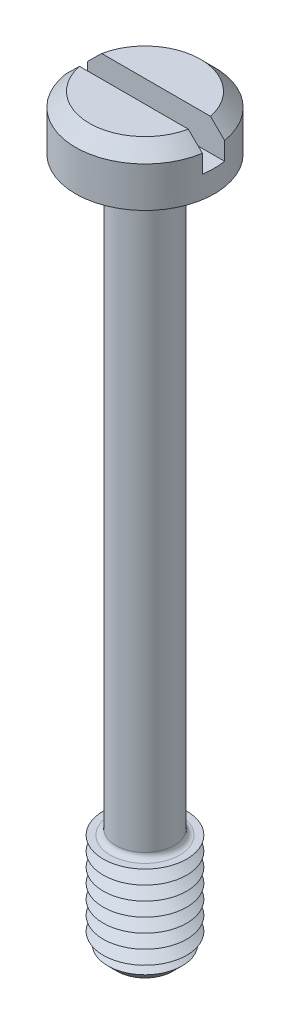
from build123d import *

# Parameters (mm, degrees)
SKETCH1_R           = 5
BOSS_EXTRUDE1_DEPTH = 3.9
SKETCH2_R           = 2.1
BOSS_EXTRUDE2_DEPTH = 50
SKETCH3_R           = 3
BOSS_EXTRUDE3_DEPTH = 7.5
CHAMFER1_SIZE       = 1
LPATTERN1_COUNT     = 7
LPATTERN1_PITCH     = 1
FILLET1_R           = 0.4
CHAMFER2_SIZE       = 1
SKETCH6_W           = 10
SKETCH6_H           = 1.6
CUT_EXTRUDE1_DEPTH  = 2.3


with BuildPart() as part:
    # Sketch1 → Boss-Extrude1 (new body)
    with BuildSketch(Plane(origin=(0, 0, 0), x_dir=(1, 0, 0), z_dir=(0, 1, 0))):
        with Locations(Location((0, 0, 0), (0, 0, 270))):
            Circle(SKETCH1_R)
    extrude(amount=BOSS_EXTRUDE1_DEPTH)

    # Sketch2 → Boss-Extrude2 (add)
    with BuildSketch(Plane.XZ):
        with Locations(Location((0, 0, 0), (0, 0, 270))):
            Circle(SKETCH2_R)
    extrude(amount=BOSS_EXTRUDE2_DEPTH)

    # Sketch3 → Boss-Extrude3 (add)
    with BuildSketch(Plane.XZ.offset(50)):
        with Locations(Location((0, 0, 0), (0, 0, 270))):
            Circle(SKETCH3_R)
    extrude(amount=-BOSS_EXTRUDE3_DEPTH)

    # Chamfer1
    chamfer1_edges = [part.edges().sort_by_distance(p)[0] for p in [
        (0, -50, 3),
    ]]
    chamfer(chamfer1_edges, length=CHAMFER1_SIZE)

    # Sketch5 → Cut-Revolve1 (revolve, cut)
    with BuildSketch(Plane(origin=(0, 0, 0), x_dir=(0, 0, -1), z_dir=(1, 0, 0))):
        Polygon((-3, -42.5), (-2.133974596, -43), (-3, -43.5), align=None)
    cut_revolve1 = revolve(axis=Axis((0, -6.58711856, 0), (0, -1, 0)), mode=Mode.SUBTRACT)

    # LPattern1: Cut-Revolve1 ×7
    with Locations(*[(0, -i * LPATTERN1_PITCH, 0) for i in range(1, LPATTERN1_COUNT)]):
        add(cut_revolve1, mode=Mode.SUBTRACT)

    # Fillet1
    fillet1_edges = [part.edges().sort_by_distance(p)[0] for p in [
        (0, 0, 2.1),
        (0, -42.5, 2.1),
    ]]
    fillet(fillet1_edges, radius=FILLET1_R)

    # Chamfer2
    chamfer2_edges = [part.edges().sort_by_distance(p)[0] for p in [
        (0, 3.9, -5),
    ]]
    chamfer(chamfer2_edges, length=CHAMFER2_SIZE)

    # Sketch6 → Cut-Extrude1 (cut)
    with BuildSketch(Plane(origin=(0, 3.9, 0), x_dir=(1, 0, 0), z_dir=(0, 1, 0))):
        Rectangle(SKETCH6_W, SKETCH6_H)
    extrude(amount=-CUT_EXTRUDE1_DEPTH, mode=Mode.SUBTRACT)


solid = part.part
